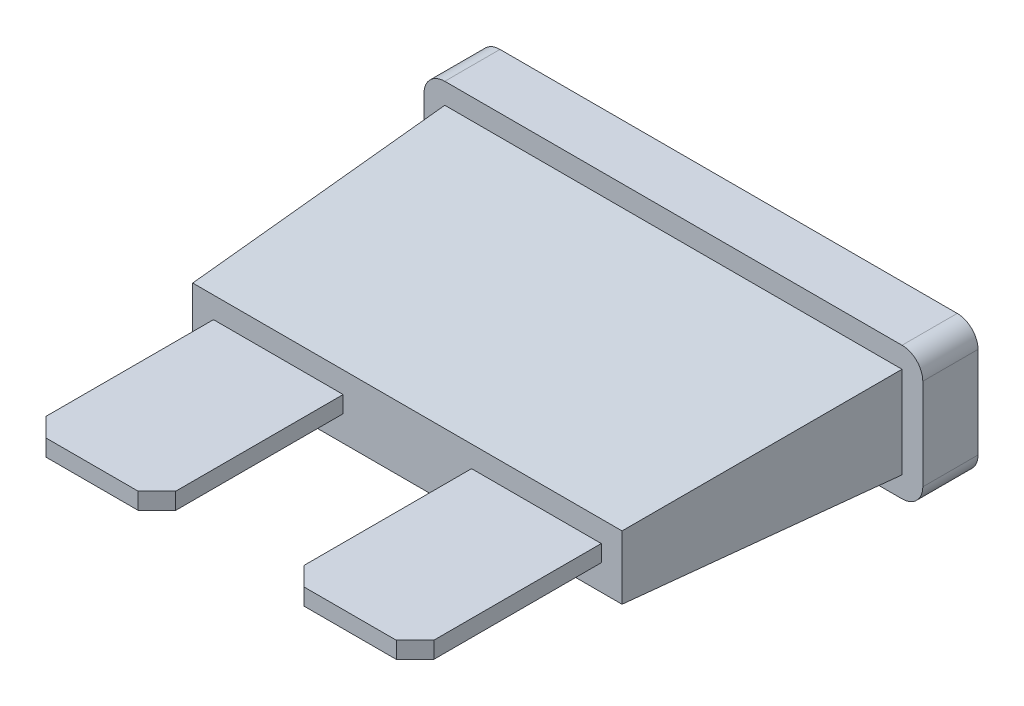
from build123d import *

# Parameters (mm, degrees)
EXTRUDE1_DEPTH       = 2.1082
SKETCH2_W            = 17.4625
SKETCH2_H            = 3.4925
EXTRUDE2_DEPTH       = 10.16
EXTRUDE2_TAPER       = 3
SKETCH3_W            = 4.953
SKETCH3_H            = 0.635
EXTRUDE3_DEPTH       = 7.112
CUT_EXTRUDE_10_DEPTH = 0.381
CUT_EXTRUDE2_DEPTH   = 22.793523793
EXTRUDE4_DEPTH       = 0.635


with BuildPart() as part:
    # Sketch1 → Extrude1 (new body)
    with BuildSketch(Plane.XY):
        with BuildLine():
            Line((-8.73125, 2.54), (8.73125, 2.54))
            ThreePointArc((8.73125, 2.54), (9.292516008, 2.307516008), (9.525, 1.74625))
            Line((9.525, 1.74625), (9.525, -1.74625))
            ThreePointArc((9.525, -1.74625), (9.292516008, -2.307516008), (8.73125, -2.54))
            Line((8.73125, -2.54), (-8.73125, -2.54))
            ThreePointArc((-8.73125, -2.54), (-9.292516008, -2.307516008), (-9.525, -1.74625))
            Line((-9.525, -1.74625), (-9.525, 1.74625))
            ThreePointArc((-9.525, 1.74625), (-9.292516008, 2.307516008), (-8.73125, 2.54))
        make_face()
    extrude(amount=EXTRUDE1_DEPTH)

    # Sketch2 → Extrude2 (add)
    with BuildSketch(Plane.XY.offset(2.1082)):
        Rectangle(SKETCH2_W, SKETCH2_H)
    extrude(amount=EXTRUDE2_DEPTH, taper=EXTRUDE2_TAPER)

    # Sketch3 → Extrude3 (add)
    with BuildSketch(Plane.XY.offset(12.2682)):
        with Locations((-4.928536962, 0.081871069)):
            Rectangle(SKETCH3_W, SKETCH3_H)
        with Locations((4.928536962, 0.081871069)):
            Rectangle(SKETCH3_W, SKETCH3_H)
    extrude(amount=EXTRUDE3_DEPTH)

    # Sketch4 → Cut-Extrude 10 (cut)
    # profile 1 of 2: a face of its own
    with BuildSketch(Plane(origin=(0, 0, 0), x_dir=(-1, 0, 0), z_dir=(0, 0, -1))):
        Polygon((-1.520682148, 1.443880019), (-1.520682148, -1.351717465), (-1.718444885, -1.351717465), (-1.718444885, -1.619931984), (-0.809774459, -1.619931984), (-0.809774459, -1.351717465), (-1.009848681, -1.351717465), (-1.009848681, 1.881366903), (-1.264109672, 1.881366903), (-1.718444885, 1.42703169), align=None)
    # profile 2 of 2: a face of its own
    with BuildSketch(Plane(origin=(0, 0, 0), x_dir=(-1, 0, 0), z_dir=(0, 0, -1))):
        with BuildLine():
            Line((1.119216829, 1.881366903), (1.666692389, 1.881366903))
            ThreePointArc((1.666692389, 1.881366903), (2.227958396, 1.64888291), (2.460442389, 1.087616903))
            Line((2.460442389, 1.087616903), (2.460442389, -0.826181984))
            ThreePointArc((2.460442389, -0.826181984), (2.227958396, -1.387447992), (1.666692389, -1.619931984))
            Line((1.666692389, -1.619931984), (1.119216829, -1.619931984))
            ThreePointArc((1.119216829, -1.619931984), (0.557950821, -1.387447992), (0.325466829, -0.826181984))
            Line((0.325466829, -0.826181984), (0.325466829, 1.087616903))
            ThreePointArc((0.325466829, 1.087616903), (0.557950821, 1.64888291), (1.119216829, 1.881366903))
        make_face()
        with BuildLine():
            Line((1.177168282, 1.443880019), (1.622974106, 1.443880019))
            ThreePointArc((1.622974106, 1.443880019), (1.903158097, 1.32782401), (2.019214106, 1.047640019))
            Line((2.019214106, 1.047640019), (2.019214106, -0.792311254))
            ThreePointArc((2.019214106, -0.792311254), (1.903158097, -1.072495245), (1.622974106, -1.188551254))
            Line((1.622974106, -1.188551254), (1.177168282, -1.188551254))
            ThreePointArc((1.177168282, -1.188551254), (0.896984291, -1.072495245), (0.780928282, -0.792311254))
            Line((0.780928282, -0.792311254), (0.780928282, 1.047640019))
            ThreePointArc((0.780928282, 1.047640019), (0.896984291, 1.32782401), (1.177168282, 1.443880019))
        make_face(mode=Mode.SUBTRACT)
    extrude(amount=-CUT_EXTRUDE_10_DEPTH, mode=Mode.SUBTRACT)

    # Sketch5 → Cut-Extrude2 (cut, through all)
    with BuildSketch(Plane(origin=(0, 0.399371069, 0), x_dir=(-1, 0, 0), z_dir=(0, 1, 0))):
        Polygon((-7.405036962, 18.664406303), (-6.689243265, 19.3802), (-7.405036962, 19.3802), align=None)
        Polygon((-2.452036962, 18.664406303), (-3.16783066, 19.3802), (-2.452036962, 19.3802), align=None)
        Polygon((2.452036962, 18.664406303), (3.16783066, 19.3802), (2.452036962, 19.3802), align=None)
        Polygon((7.405036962, 18.664406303), (6.689243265, 19.3802), (7.405036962, 19.3802), align=None)
    extrude(amount=-CUT_EXTRUDE2_DEPTH, mode=Mode.SUBTRACT)


with BuildPart() as body_2:
    # Sketch6 → Extrude4 (new body)
    with BuildSketch(Plane(origin=(0, 0.399371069, 0), x_dir=(-1, 0, 0), z_dir=(0, 1, 0))):
        with BuildLine():
            Line((-6.444053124, 12.2682), (-3.413020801, 12.2682))
            Line((-3.413020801, 12.2682), (-3.413020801, 9.674580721))
            ThreePointArc((-3.413020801, 9.674580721), (-1.985531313, 8.533534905), (-1.447532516, 6.787032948))
            ThreePointArc((-1.447532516, 6.787032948), (0, 5.339500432), (1.447532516, 6.787032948))
            ThreePointArc((1.447532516, 6.787032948), (1.985531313, 8.533534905), (3.413020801, 9.674580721))
            Line((3.413020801, 9.674580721), (3.413020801, 12.2682))
            Line((3.413020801, 12.2682), (6.444053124, 12.2682))
            Line((6.444053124, 12.2682), (6.444053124, 8.458026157))
            Line((6.444053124, 8.458026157), (3.795908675, 8.458026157))
            ThreePointArc((3.795908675, 8.458026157), (3.010533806, 7.781406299), (2.717532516, 6.787032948))
            ThreePointArc((2.717532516, 6.787032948), (0, 4.069500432), (-2.717532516, 6.787032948))
            ThreePointArc((-2.717532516, 6.787032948), (-3.010533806, 7.781406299), (-3.795908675, 8.458026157))
            Line((-3.795908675, 8.458026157), (-6.444053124, 8.458026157))
            Line((-6.444053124, 8.458026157), (-6.444053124, 12.2682))
        make_face()
    extrude(amount=-EXTRUDE4_DEPTH)


solid = Compound([part.part, body_2.part])
